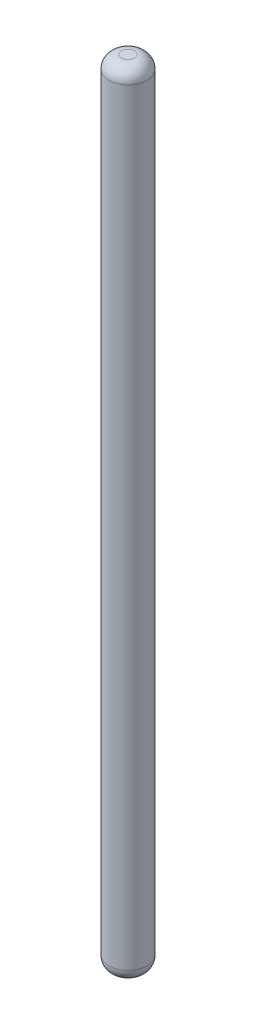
ISO-10303-21;
HEADER;
FILE_DESCRIPTION(('STEP AP214'),'2;1');
FILE_NAME('part.step','',(''),(''),'','','');
FILE_SCHEMA(('AUTOMOTIVE_DESIGN { 1 0 10303 214 1 1 1 1 }'));
ENDSEC;
DATA;
#1=APPLICATION_CONTEXT('core data for automotive mechanical design processes');
#2=APPLICATION_PROTOCOL_DEFINITION('international standard','automotive_design',2000,#1);
#3=PRODUCT_CONTEXT('',#1,'mechanical');
#4=PRODUCT('Part','Part','',(#3));
#5=PRODUCT_RELATED_PRODUCT_CATEGORY('part','',(#4));
#6=PRODUCT_DEFINITION_FORMATION('','',#4);
#7=PRODUCT_DEFINITION_CONTEXT('part definition',#1,'design');
#8=PRODUCT_DEFINITION('design','',#6,#7);
#9=PRODUCT_DEFINITION_SHAPE('','',#8);
#10=(LENGTH_UNIT() NAMED_UNIT(*) SI_UNIT(.MILLI.,.METRE.));
#11=(NAMED_UNIT(*) PLANE_ANGLE_UNIT() SI_UNIT($,.RADIAN.));
#12=(NAMED_UNIT(*) SI_UNIT($,.STERADIAN.) SOLID_ANGLE_UNIT());
#13=UNCERTAINTY_MEASURE_WITH_UNIT(LENGTH_MEASURE(1.E-05),#10,'distance_accuracy_value','');
#14=(GEOMETRIC_REPRESENTATION_CONTEXT(3) GLOBAL_UNCERTAINTY_ASSIGNED_CONTEXT((#13)) GLOBAL_UNIT_ASSIGNED_CONTEXT((#10,
#11,#12)) REPRESENTATION_CONTEXT('',''));
#15=CARTESIAN_POINT('',(0.,0.,0.));
#16=DIRECTION('',(0.,0.,1.));
#17=DIRECTION('',(1.,0.,0.));
#18=AXIS2_PLACEMENT_3D('',#15,#16,#17);
#19=CARTESIAN_POINT('',(0.,62.,0.));
#20=DIRECTION('',(0.,-1.,0.));
#21=DIRECTION('',(0.,0.,-1.));
#22=AXIS2_PLACEMENT_3D('',#19,#20,#21);
#23=CYLINDRICAL_SURFACE('',#22,1.5);
#24=CARTESIAN_POINT('',(0.,1.,0.));
#25=DIRECTION('',(0.,1.,0.));
#26=DIRECTION('',(0.,0.,1.));
#27=AXIS2_PLACEMENT_3D('',#24,#25,#26);
#28=CIRCLE('',#27,1.5);
#29=CARTESIAN_POINT('',(0.,1.,1.5));
#30=VERTEX_POINT('',#29);
#31=EDGE_CURVE('E50',#30,#30,#28,.T.);
#32=ORIENTED_EDGE('',*,*,#31,.T.);
#33=EDGE_LOOP('',(#32));
#34=FACE_BOUND('',#33,.T.);
#35=CARTESIAN_POINT('',(0.,61.,0.));
#36=DIRECTION('',(0.,1.,0.));
#37=DIRECTION('',(0.,0.,1.));
#38=AXIS2_PLACEMENT_3D('',#35,#36,#37);
#39=CIRCLE('',#38,1.5);
#40=CARTESIAN_POINT('',(0.,61.,1.5));
#41=VERTEX_POINT('',#40);
#42=EDGE_CURVE('E55',#41,#41,#39,.F.);
#43=ORIENTED_EDGE('',*,*,#42,.T.);
#44=EDGE_LOOP('',(#43));
#45=FACE_BOUND('',#44,.T.);
#46=ADVANCED_FACE('F37',(#34,#45),#23,.T.);
#47=CARTESIAN_POINT('',(0.,62.,0.));
#48=DIRECTION('',(0.,1.,0.));
#49=DIRECTION('',(0.,0.,1.));
#50=AXIS2_PLACEMENT_3D('',#47,#48,#49);
#51=PLANE('',#50);
#52=CARTESIAN_POINT('',(0.,62.,0.));
#53=DIRECTION('',(0.,1.,0.));
#54=DIRECTION('',(0.,0.,1.));
#55=AXIS2_PLACEMENT_3D('',#52,#53,#54);
#56=CIRCLE('',#55,0.5);
#57=CARTESIAN_POINT('',(0.,62.,0.5));
#58=VERTEX_POINT('',#57);
#59=EDGE_CURVE('E10',#58,#58,#56,.T.);
#60=ORIENTED_EDGE('',*,*,#59,.T.);
#61=EDGE_LOOP('',(#60));
#62=FACE_BOUND('',#61,.T.);
#63=ADVANCED_FACE('F72',(#62),#51,.T.);
#64=CARTESIAN_POINT('',(0.,0.,0.));
#65=DIRECTION('',(0.,1.,0.));
#66=DIRECTION('',(0.,0.,1.));
#67=AXIS2_PLACEMENT_3D('',#64,#65,#66);
#68=PLANE('',#67);
#69=CARTESIAN_POINT('',(0.,0.,0.));
#70=DIRECTION('',(0.,1.,0.));
#71=DIRECTION('',(0.,0.,1.));
#72=AXIS2_PLACEMENT_3D('',#69,#70,#71);
#73=CIRCLE('',#72,0.5);
#74=CARTESIAN_POINT('',(0.,0.,0.5));
#75=VERTEX_POINT('',#74);
#76=EDGE_CURVE('E45',#75,#75,#73,.F.);
#77=ORIENTED_EDGE('',*,*,#76,.T.);
#78=EDGE_LOOP('',(#77));
#79=FACE_BOUND('',#78,.T.);
#80=ADVANCED_FACE('F69',(#79),#68,.F.);
#81=CARTESIAN_POINT('',(0.,1.,0.));
#82=DIRECTION('',(0.,1.,0.));
#83=DIRECTION('',(0.,0.,1.));
#84=AXIS2_PLACEMENT_3D('',#81,#82,#83);
#85=DEGENERATE_TOROIDAL_SURFACE('',#84,0.5,1.,.T.);
#86=ORIENTED_EDGE('',*,*,#76,.F.);
#87=EDGE_LOOP('',(#86));
#88=FACE_BOUND('',#87,.T.);
#89=ORIENTED_EDGE('',*,*,#31,.F.);
#90=EDGE_LOOP('',(#89));
#91=FACE_BOUND('',#90,.T.);
#92=ADVANCED_FACE('F65',(#88,#91),#85,.T.);
#93=CARTESIAN_POINT('',(0.,61.,0.));
#94=DIRECTION('',(0.,1.,0.));
#95=DIRECTION('',(0.,0.,1.));
#96=AXIS2_PLACEMENT_3D('',#93,#94,#95);
#97=DEGENERATE_TOROIDAL_SURFACE('',#96,0.5,1.,.T.);
#98=ORIENTED_EDGE('',*,*,#42,.F.);
#99=EDGE_LOOP('',(#98));
#100=FACE_BOUND('',#99,.T.);
#101=ORIENTED_EDGE('',*,*,#59,.F.);
#102=EDGE_LOOP('',(#101));
#103=FACE_BOUND('',#102,.T.);
#104=ADVANCED_FACE('F39',(#100,#103),#97,.T.);
#105=CLOSED_SHELL('',(#46,#63,#80,#92,#104));
#106=MANIFOLD_SOLID_BREP('B2',#105);
#107=ADVANCED_BREP_SHAPE_REPRESENTATION('',(#18,#106),#14);
#108=SHAPE_DEFINITION_REPRESENTATION(#9,#107);
ENDSEC;
END-ISO-10303-21;
